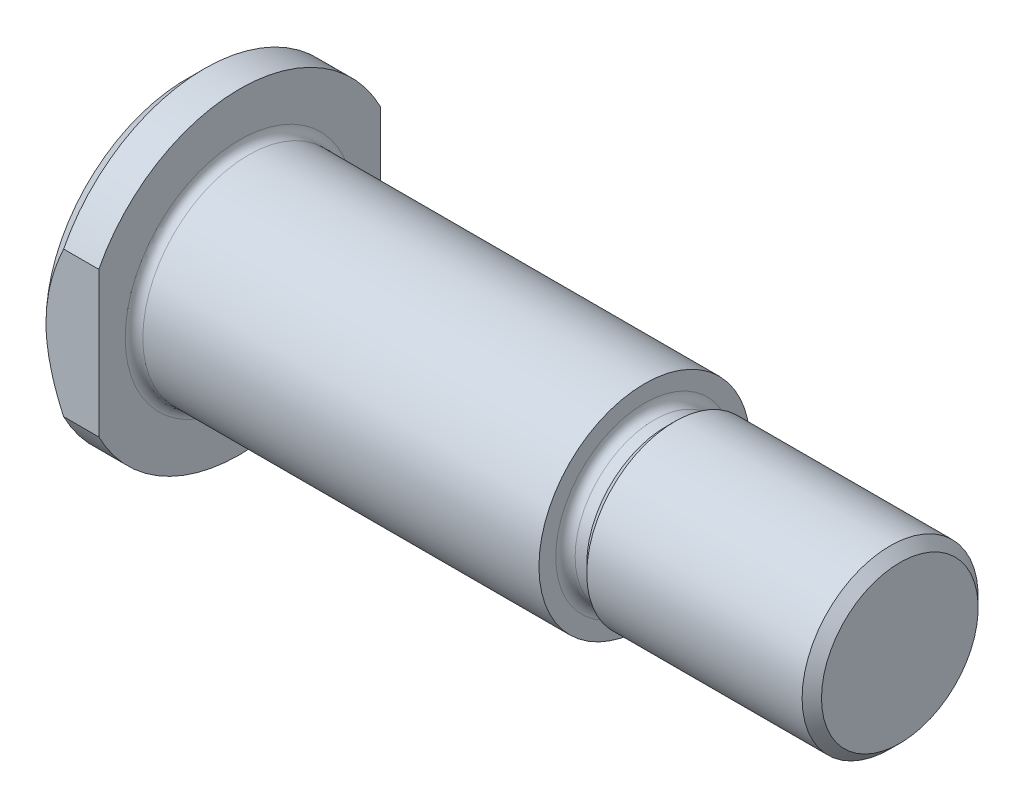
from build123d import *

# Parameters (mm, degrees)
SKETCH1_W          = 2
SKETCH1_H          = 36
CUT_EXTRUDE1_DEPTH = 6
FILLET1_R          = 1


with BuildPart() as part:
    # BodySke → BaseBody (revolve)
    with BuildSketch(Plane.XY, mode=Mode.PRIVATE) as basebody_sk:
        with BuildLine():
            Line((0, 0), (0, 16))
            Line((0, 16), (2, 18))
            Line((2, 18), (6, 18))
            Line((6, 18), (6, 12))
            Line((6, 12), (52, 12))
            Line((52, 12), (52, 10.088985))
            ThreePointArc((52, 10.088985), (52.322621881, 9.310106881), (53.1015, 8.987485))
            Line((53.1015, 8.987485), (54.4233, 8.987485))
            Line((54.4233, 8.987485), (55.435815, 10))
            Line((55.435815, 10), (79.8985, 10))
            Line((79.8985, 10), (81, 8.8985))
            Line((81, 8.8985), (81, 0))
            Line((81, 0), (0, 0))
        make_face()
    revolve(basebody_sk.sketch.rotate(Axis((-6.35, 0, 0), (1, 0, 0)), 90), axis=Axis((-6.35, 0, 0), (1, 0, 0)))

    # Sketch1 → Cut-Extrude1 (cut)
    with BuildSketch(Plane.ZY):
        with Locations((-17, 0)):
            Rectangle(SKETCH1_W, SKETCH1_H)
        with Locations((17, 0)):
            Rectangle(SKETCH1_W, SKETCH1_H)
    extrude(amount=-CUT_EXTRUDE1_DEPTH, mode=Mode.SUBTRACT)

    # Fillet1
    fillet1_edges = [part.edges().sort_by_distance(p)[0] for p in [
        (6, 0, -12),
    ]]
    fillet(fillet1_edges, radius=FILLET1_R)


solid = part.part
